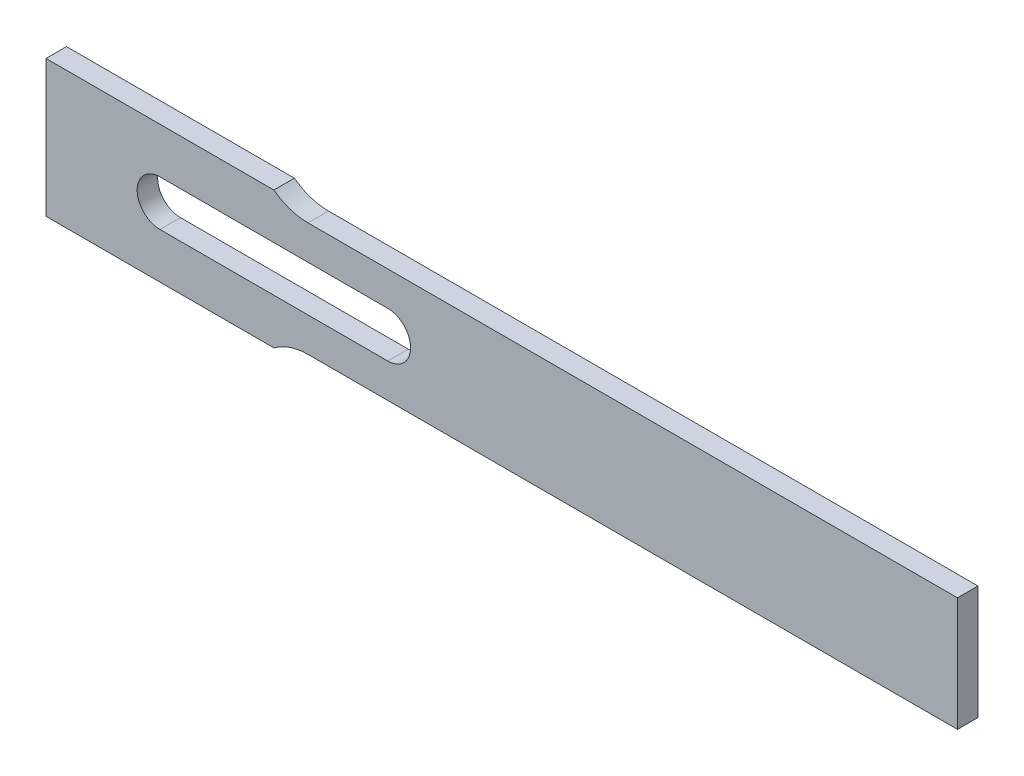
from build123d import *

# Parameters (mm, degrees)
EXTRUDE1_DEPTH = 1.8
EXTRUDE2_DEPTH = 81.244875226


with BuildPart() as part:
    # Sketch1 → Extrude1 (new body)
    with BuildSketch(Plane.XY):
        with BuildLine():
            Line((80, 5), (23, 5))
            ThreePointArc((23, 5), (21.41886117, 5.25658351), (20, 6))
            Line((20, 6), (0, 6))
            Line((0, 6), (0, -6))
            Line((0, -6), (20, -6))
            ThreePointArc((20, -6), (21.41886117, -5.25658351), (23, -5))
            Line((23, -5), (80, -5))
            Line((80, -5), (80, 5))
        make_face()
    extrude(amount=EXTRUDE1_DEPTH)

    # Sketch2 → Extrude2 (cut, through all)
    with BuildSketch(Plane.XY):
        with BuildLine():
            Line((10, -2), (30, -2))
            ThreePointArc((30, -2), (32, 0), (30, 2))
            Line((30, 2), (10, 2))
            ThreePointArc((10, 2), (8, 0), (10, -2))
        make_face()
    extrude(amount=EXTRUDE2_DEPTH, mode=Mode.SUBTRACT)


solid = part.part
